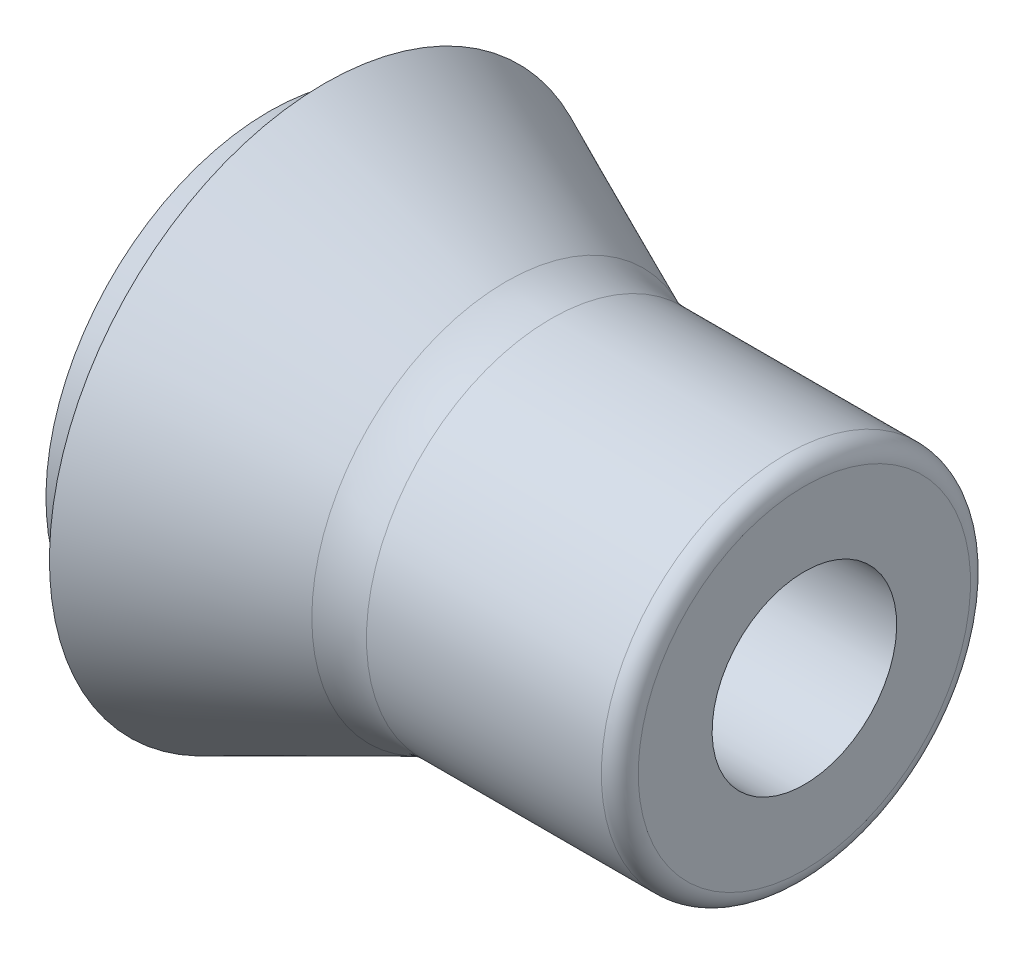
from build123d import *


with BuildPart() as part:
    # Esquisse1 → Base-R_volution (revolve)
    with BuildSketch(Plane.XY):
        with BuildLine():
            Line((0, 9), (0, 5))
            Line((0, 5), (-22, 5))
            Line((-22, 5), (-22, 9))
            Line((-22, 9), (-29, 9))
            Line((-29, 9), (-29, 12.085686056))
            Line((-29, 12.085686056), (-26, 10.75))
            Line((-26, 10.75), (-26, 14.897515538))
            Line((-26, 14.897515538), (-16.165080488, 10.518727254))
            ThreePointArc((-16.165080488, 10.518727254), (-14.972130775, 10.131114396), (-13.72466063, 10))
            Line((-13.72466063, 10), (-1, 10))
            ThreePointArc((-1, 10), (-0.292893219, 9.707106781), (0, 9))
        make_face()
    revolve(axis=Axis((0, 0, 0), (-1, 0, 0)))


solid = part.part
